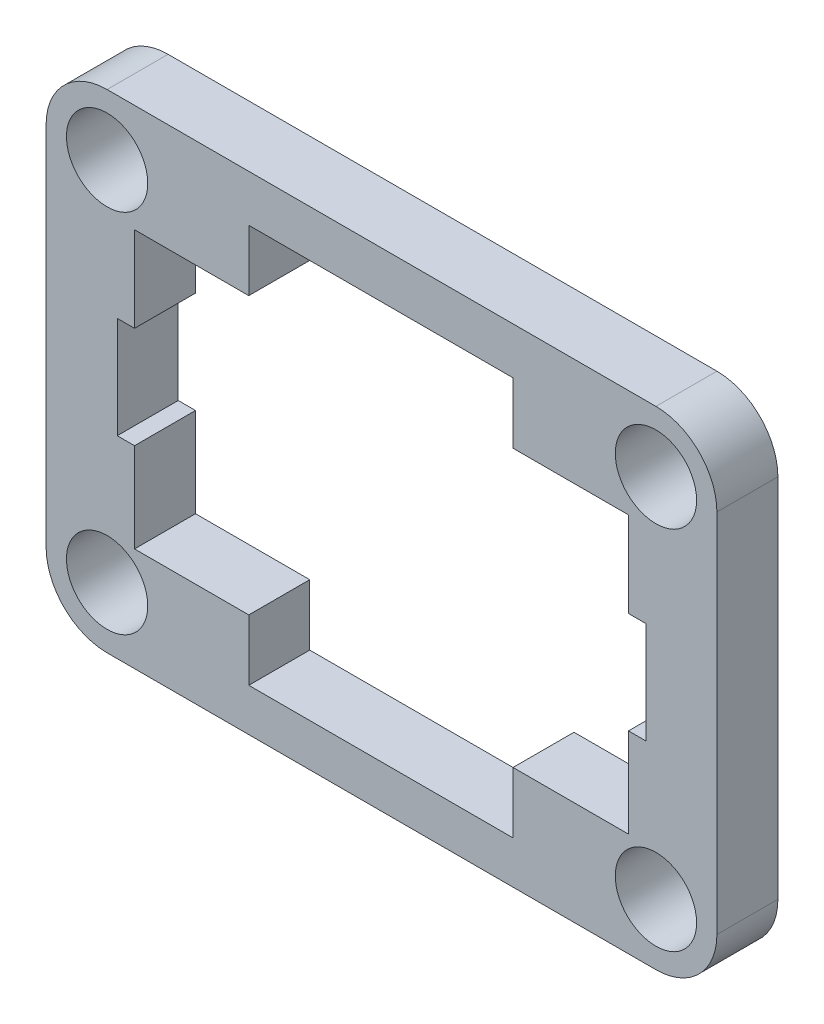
ISO-10303-21;
HEADER;
FILE_DESCRIPTION(('STEP AP214'),'2;1');
FILE_NAME('part.step','',(''),(''),'','','');
FILE_SCHEMA(('AUTOMOTIVE_DESIGN { 1 0 10303 214 1 1 1 1 }'));
ENDSEC;
DATA;
#1=APPLICATION_CONTEXT('core data for automotive mechanical design processes');
#2=APPLICATION_PROTOCOL_DEFINITION('international standard','automotive_design',2000,#1);
#3=PRODUCT_CONTEXT('',#1,'mechanical');
#4=PRODUCT('Part','Part','',(#3));
#5=PRODUCT_RELATED_PRODUCT_CATEGORY('part','',(#4));
#6=PRODUCT_DEFINITION_FORMATION('','',#4);
#7=PRODUCT_DEFINITION_CONTEXT('part definition',#1,'design');
#8=PRODUCT_DEFINITION('design','',#6,#7);
#9=PRODUCT_DEFINITION_SHAPE('','',#8);
#10=(LENGTH_UNIT() NAMED_UNIT(*) SI_UNIT(.MILLI.,.METRE.));
#11=(NAMED_UNIT(*) PLANE_ANGLE_UNIT() SI_UNIT($,.RADIAN.));
#12=(NAMED_UNIT(*) SI_UNIT($,.STERADIAN.) SOLID_ANGLE_UNIT());
#13=UNCERTAINTY_MEASURE_WITH_UNIT(LENGTH_MEASURE(1.E-05),#10,'distance_accuracy_value','');
#14=(GEOMETRIC_REPRESENTATION_CONTEXT(3) GLOBAL_UNCERTAINTY_ASSIGNED_CONTEXT((#13)) GLOBAL_UNIT_ASSIGNED_CONTEXT((#10,
#11,#12)) REPRESENTATION_CONTEXT('',''));
#15=CARTESIAN_POINT('',(0.,0.,0.));
#16=DIRECTION('',(0.,0.,1.));
#17=DIRECTION('',(1.,0.,0.));
#18=AXIS2_PLACEMENT_3D('',#15,#16,#17);
#19=CARTESIAN_POINT('',(27.5302510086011,-20.1514477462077,3.));
#20=DIRECTION('',(0.,-1.,0.));
#21=DIRECTION('',(0.,0.,-1.));
#22=AXIS2_PLACEMENT_3D('',#19,#20,#21);
#23=PLANE('',#22);
#24=DIRECTION('',(1.,0.,0.));
#25=VECTOR('',#24,1.);
#26=CARTESIAN_POINT('',(27.5302510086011,-20.1514477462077,0.));
#27=LINE('',#26,#25);
#28=CARTESIAN_POINT('',(27.5302510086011,-20.1514477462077,0.));
#29=VERTEX_POINT('',#28);
#30=CARTESIAN_POINT('',(28.38,-20.1514477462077,0.));
#31=VERTEX_POINT('',#30);
#32=EDGE_CURVE('E324',#29,#31,#27,.T.);
#33=ORIENTED_EDGE('',*,*,#32,.T.);
#34=DIRECTION('',(0.,0.,1.));
#35=VECTOR('',#34,1.);
#36=CARTESIAN_POINT('',(28.38,-20.1514477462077,3.));
#37=LINE('',#36,#35);
#38=CARTESIAN_POINT('',(28.38,-20.1514477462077,3.));
#39=VERTEX_POINT('',#38);
#40=EDGE_CURVE('E321',#31,#39,#37,.T.);
#41=ORIENTED_EDGE('',*,*,#40,.T.);
#42=DIRECTION('',(1.,0.,0.));
#43=VECTOR('',#42,1.);
#44=CARTESIAN_POINT('',(27.0302510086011,-20.1514477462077,3.));
#45=LINE('',#44,#43);
#46=CARTESIAN_POINT('',(27.5302510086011,-20.1514477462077,3.));
#47=VERTEX_POINT('',#46);
#48=EDGE_CURVE('E396',#47,#39,#45,.T.);
#49=ORIENTED_EDGE('',*,*,#48,.F.);
#50=DIRECTION('',(0.,0.,-1.));
#51=VECTOR('',#50,1.);
#52=CARTESIAN_POINT('',(27.5302510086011,-20.1514477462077,3.));
#53=LINE('',#52,#51);
#54=EDGE_CURVE('E361',#29,#47,#53,.F.);
#55=ORIENTED_EDGE('',*,*,#54,.F.);
#56=EDGE_LOOP('',(#33,#41,#49,#55));
#57=FACE_BOUND('',#56,.T.);
#58=ADVANCED_FACE('F31',(#57),#23,.T.);
#59=CARTESIAN_POINT('',(52.0302510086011,-20.1514477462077,3.));
#60=DIRECTION('',(0.,-1.,0.));
#61=DIRECTION('',(0.,0.,-1.));
#62=AXIS2_PLACEMENT_3D('',#59,#60,#61);
#63=PLANE('',#62);
#64=DIRECTION('',(1.,0.,0.));
#65=VECTOR('',#64,1.);
#66=CARTESIAN_POINT('',(27.0302510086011,-20.1514477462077,3.));
#67=LINE('',#66,#65);
#68=CARTESIAN_POINT('',(52.68,-20.1514477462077,3.));
#69=VERTEX_POINT('',#68);
#70=CARTESIAN_POINT('',(53.5302510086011,-20.1514477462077,3.));
#71=VERTEX_POINT('',#70);
#72=EDGE_CURVE('E394',#69,#71,#67,.T.);
#73=ORIENTED_EDGE('',*,*,#72,.F.);
#74=DIRECTION('',(0.,0.,-1.));
#75=VECTOR('',#74,1.);
#76=CARTESIAN_POINT('',(52.68,-20.1514477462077,3.));
#77=LINE('',#76,#75);
#78=CARTESIAN_POINT('',(52.68,-20.1514477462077,0.));
#79=VERTEX_POINT('',#78);
#80=EDGE_CURVE('E317',#69,#79,#77,.T.);
#81=ORIENTED_EDGE('',*,*,#80,.T.);
#82=DIRECTION('',(1.,0.,0.));
#83=VECTOR('',#82,1.);
#84=CARTESIAN_POINT('',(52.0302510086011,-20.1514477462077,0.));
#85=LINE('',#84,#83);
#86=CARTESIAN_POINT('',(53.5302510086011,-20.1514477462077,0.));
#87=VERTEX_POINT('',#86);
#88=EDGE_CURVE('E406',#79,#87,#85,.T.);
#89=ORIENTED_EDGE('',*,*,#88,.T.);
#90=DIRECTION('',(0.,0.,1.));
#91=VECTOR('',#90,1.);
#92=CARTESIAN_POINT('',(53.5302510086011,-20.1514477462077,3.));
#93=LINE('',#92,#91);
#94=EDGE_CURVE('E347',#71,#87,#93,.F.);
#95=ORIENTED_EDGE('',*,*,#94,.F.);
#96=EDGE_LOOP('',(#73,#81,#89,#95));
#97=FACE_BOUND('',#96,.T.);
#98=ADVANCED_FACE('F439',(#97),#63,.T.);
#99=CARTESIAN_POINT('',(52.0302510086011,-25.1514477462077,3.));
#100=DIRECTION('',(0.,1.,0.));
#101=DIRECTION('',(0.,0.,1.));
#102=AXIS2_PLACEMENT_3D('',#99,#100,#101);
#103=PLANE('',#102);
#104=DIRECTION('',(1.,0.,0.));
#105=VECTOR('',#104,1.);
#106=CARTESIAN_POINT('',(52.0302510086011,-25.1514477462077,0.));
#107=LINE('',#106,#105);
#108=CARTESIAN_POINT('',(53.5302510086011,-25.1514477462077,0.));
#109=VERTEX_POINT('',#108);
#110=CARTESIAN_POINT('',(52.68,-25.1514477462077,0.));
#111=VERTEX_POINT('',#110);
#112=EDGE_CURVE('E403',#109,#111,#107,.F.);
#113=ORIENTED_EDGE('',*,*,#112,.T.);
#114=DIRECTION('',(0.,0.,1.));
#115=VECTOR('',#114,1.);
#116=CARTESIAN_POINT('',(52.68,-25.1514477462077,3.));
#117=LINE('',#116,#115);
#118=CARTESIAN_POINT('',(52.68,-25.1514477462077,3.));
#119=VERTEX_POINT('',#118);
#120=EDGE_CURVE('E53',#111,#119,#117,.T.);
#121=ORIENTED_EDGE('',*,*,#120,.T.);
#122=DIRECTION('',(1.,0.,0.));
#123=VECTOR('',#122,1.);
#124=CARTESIAN_POINT('',(27.0302510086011,-25.1514477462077,3.));
#125=LINE('',#124,#123);
#126=CARTESIAN_POINT('',(53.5302510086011,-25.1514477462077,3.));
#127=VERTEX_POINT('',#126);
#128=EDGE_CURVE('E390',#127,#119,#125,.F.);
#129=ORIENTED_EDGE('',*,*,#128,.F.);
#130=DIRECTION('',(0.,0.,1.));
#131=VECTOR('',#130,1.);
#132=CARTESIAN_POINT('',(53.5302510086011,-25.1514477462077,3.));
#133=LINE('',#132,#131);
#134=EDGE_CURVE('E353',#109,#127,#133,.T.);
#135=ORIENTED_EDGE('',*,*,#134,.F.);
#136=EDGE_LOOP('',(#113,#121,#129,#135));
#137=FACE_BOUND('',#136,.T.);
#138=ADVANCED_FACE('F486',(#137),#103,.T.);
#139=CARTESIAN_POINT('',(27.5302510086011,-25.1514477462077,3.));
#140=DIRECTION('',(0.,1.,0.));
#141=DIRECTION('',(0.,0.,1.));
#142=AXIS2_PLACEMENT_3D('',#139,#140,#141);
#143=PLANE('',#142);
#144=DIRECTION('',(1.,0.,0.));
#145=VECTOR('',#144,1.);
#146=CARTESIAN_POINT('',(27.0302510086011,-25.1514477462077,3.));
#147=LINE('',#146,#145);
#148=CARTESIAN_POINT('',(28.38,-25.1514477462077,3.));
#149=VERTEX_POINT('',#148);
#150=CARTESIAN_POINT('',(27.5302510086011,-25.1514477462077,3.));
#151=VERTEX_POINT('',#150);
#152=EDGE_CURVE('E399',#149,#151,#147,.F.);
#153=ORIENTED_EDGE('',*,*,#152,.F.);
#154=DIRECTION('',(0.,0.,-1.));
#155=VECTOR('',#154,1.);
#156=CARTESIAN_POINT('',(28.38,-25.1514477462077,3.));
#157=LINE('',#156,#155);
#158=CARTESIAN_POINT('',(28.38,-25.1514477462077,0.));
#159=VERTEX_POINT('',#158);
#160=EDGE_CURVE('E222',#149,#159,#157,.T.);
#161=ORIENTED_EDGE('',*,*,#160,.T.);
#162=DIRECTION('',(1.,0.,0.));
#163=VECTOR('',#162,1.);
#164=CARTESIAN_POINT('',(27.5302510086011,-25.1514477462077,0.));
#165=LINE('',#164,#163);
#166=CARTESIAN_POINT('',(27.5302510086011,-25.1514477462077,0.));
#167=VERTEX_POINT('',#166);
#168=EDGE_CURVE('E401',#159,#167,#165,.F.);
#169=ORIENTED_EDGE('',*,*,#168,.T.);
#170=DIRECTION('',(0.,0.,-1.));
#171=VECTOR('',#170,1.);
#172=CARTESIAN_POINT('',(27.5302510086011,-25.1514477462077,3.));
#173=LINE('',#172,#171);
#174=EDGE_CURVE('E355',#151,#167,#173,.T.);
#175=ORIENTED_EDGE('',*,*,#174,.F.);
#176=EDGE_LOOP('',(#153,#161,#169,#175));
#177=FACE_BOUND('',#176,.T.);
#178=ADVANCED_FACE('F484',(#177),#143,.T.);
#179=CARTESIAN_POINT('',(27.0302510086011,-31.6514477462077,3.));
#180=DIRECTION('',(0.,0.,1.));
#181=DIRECTION('',(1.,0.,0.));
#182=AXIS2_PLACEMENT_3D('',#179,#180,#181);
#183=PLANE('',#182);
#184=CARTESIAN_POINT('',(27.0302510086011,-31.6514477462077,3.));
#185=DIRECTION('',(0.,0.,1.));
#186=DIRECTION('',(1.,0.,0.));
#187=AXIS2_PLACEMENT_3D('',#184,#185,#186);
#188=CIRCLE('',#187,2.);
#189=CARTESIAN_POINT('',(29.0302510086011,-31.6514477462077,3.));
#190=VERTEX_POINT('',#189);
#191=EDGE_CURVE('E814',#190,#190,#188,.T.);
#192=ORIENTED_EDGE('',*,*,#191,.F.);
#193=EDGE_LOOP('',(#192));
#194=FACE_BOUND('',#193,.T.);
#195=CARTESIAN_POINT('',(54.0302510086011,-31.6514477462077,3.));
#196=DIRECTION('',(0.,0.,1.));
#197=DIRECTION('',(1.,0.,0.));
#198=AXIS2_PLACEMENT_3D('',#195,#196,#197);
#199=CIRCLE('',#198,2.);
#200=CARTESIAN_POINT('',(56.0302510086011,-31.6514477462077,3.));
#201=VERTEX_POINT('',#200);
#202=EDGE_CURVE('E816',#201,#201,#199,.T.);
#203=ORIENTED_EDGE('',*,*,#202,.F.);
#204=EDGE_LOOP('',(#203));
#205=FACE_BOUND('',#204,.T.);
#206=CARTESIAN_POINT('',(54.0302510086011,-13.6514477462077,3.));
#207=DIRECTION('',(0.,0.,1.));
#208=DIRECTION('',(1.,0.,0.));
#209=AXIS2_PLACEMENT_3D('',#206,#207,#208);
#210=CIRCLE('',#209,2.);
#211=CARTESIAN_POINT('',(56.0302510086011,-13.6514477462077,3.));
#212=VERTEX_POINT('',#211);
#213=EDGE_CURVE('E822',#212,#212,#210,.T.);
#214=ORIENTED_EDGE('',*,*,#213,.F.);
#215=EDGE_LOOP('',(#214));
#216=FACE_BOUND('',#215,.T.);
#217=CARTESIAN_POINT('',(27.0302510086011,-13.6514477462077,3.));
#218=DIRECTION('',(0.,0.,1.));
#219=DIRECTION('',(1.,0.,0.));
#220=AXIS2_PLACEMENT_3D('',#217,#218,#219);
#221=CIRCLE('',#220,2.);
#222=CARTESIAN_POINT('',(29.0302510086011,-13.6514477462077,3.));
#223=VERTEX_POINT('',#222);
#224=EDGE_CURVE('E828',#223,#223,#221,.T.);
#225=ORIENTED_EDGE('',*,*,#224,.F.);
#226=EDGE_LOOP('',(#225));
#227=FACE_BOUND('',#226,.T.);
#228=CARTESIAN_POINT('',(27.0302510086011,-13.6514477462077,3.));
#229=DIRECTION('',(0.,0.,-1.));
#230=DIRECTION('',(-1.,0.,0.));
#231=AXIS2_PLACEMENT_3D('',#228,#229,#230);
#232=CIRCLE('',#231,3.);
#233=CARTESIAN_POINT('',(24.0302510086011,-13.6514477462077,3.));
#234=VERTEX_POINT('',#233);
#235=CARTESIAN_POINT('',(27.0302510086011,-10.6514477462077,3.));
#236=VERTEX_POINT('',#235);
#237=EDGE_CURVE('E375',#234,#236,#232,.T.);
#238=ORIENTED_EDGE('',*,*,#237,.F.);
#239=DIRECTION('',(0.,1.,0.));
#240=VECTOR('',#239,1.);
#241=CARTESIAN_POINT('',(24.0302510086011,-13.6514477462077,3.));
#242=LINE('',#241,#240);
#243=CARTESIAN_POINT('',(24.0302510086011,-31.6514477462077,3.));
#244=VERTEX_POINT('',#243);
#245=EDGE_CURVE('E369',#234,#244,#242,.F.);
#246=ORIENTED_EDGE('',*,*,#245,.T.);
#247=CARTESIAN_POINT('',(27.0302510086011,-31.6514477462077,3.));
#248=DIRECTION('',(0.,0.,-1.));
#249=DIRECTION('',(-1.,0.,0.));
#250=AXIS2_PLACEMENT_3D('',#247,#248,#249);
#251=CIRCLE('',#250,3.);
#252=CARTESIAN_POINT('',(27.0302510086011,-34.6514477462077,3.));
#253=VERTEX_POINT('',#252);
#254=EDGE_CURVE('E365',#253,#244,#251,.T.);
#255=ORIENTED_EDGE('',*,*,#254,.F.);
#256=DIRECTION('',(1.,0.,0.));
#257=VECTOR('',#256,1.);
#258=CARTESIAN_POINT('',(27.0302510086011,-34.6514477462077,3.));
#259=LINE('',#258,#257);
#260=CARTESIAN_POINT('',(54.0302510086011,-34.6514477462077,3.));
#261=VERTEX_POINT('',#260);
#262=EDGE_CURVE('E393',#253,#261,#259,.T.);
#263=ORIENTED_EDGE('',*,*,#262,.T.);
#264=CARTESIAN_POINT('',(54.0302510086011,-31.6514477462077,3.));
#265=DIRECTION('',(0.,0.,-1.));
#266=DIRECTION('',(-1.,0.,0.));
#267=AXIS2_PLACEMENT_3D('',#264,#265,#266);
#268=CIRCLE('',#267,3.);
#269=CARTESIAN_POINT('',(57.0302510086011,-31.6514477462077,3.));
#270=VERTEX_POINT('',#269);
#271=EDGE_CURVE('E389',#270,#261,#268,.T.);
#272=ORIENTED_EDGE('',*,*,#271,.F.);
#273=DIRECTION('',(0.,-1.,0.));
#274=VECTOR('',#273,1.);
#275=CARTESIAN_POINT('',(57.0302510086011,-13.6514477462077,3.));
#276=LINE('',#275,#274);
#277=CARTESIAN_POINT('',(57.0302510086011,-13.6514477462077,3.));
#278=VERTEX_POINT('',#277);
#279=EDGE_CURVE('E386',#270,#278,#276,.F.);
#280=ORIENTED_EDGE('',*,*,#279,.T.);
#281=CARTESIAN_POINT('',(54.0302510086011,-13.6514477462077,3.));
#282=DIRECTION('',(0.,0.,-1.));
#283=DIRECTION('',(-1.,0.,0.));
#284=AXIS2_PLACEMENT_3D('',#281,#282,#283);
#285=CIRCLE('',#284,3.);
#286=CARTESIAN_POINT('',(54.0302510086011,-10.6514477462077,3.));
#287=VERTEX_POINT('',#286);
#288=EDGE_CURVE('E382',#287,#278,#285,.T.);
#289=ORIENTED_EDGE('',*,*,#288,.F.);
#290=DIRECTION('',(1.,0.,0.));
#291=VECTOR('',#290,1.);
#292=CARTESIAN_POINT('',(27.0302510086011,-10.6514477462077,3.));
#293=LINE('',#292,#291);
#294=EDGE_CURVE('E379',#287,#236,#293,.F.);
#295=ORIENTED_EDGE('',*,*,#294,.T.);
#296=EDGE_LOOP('',(#238,#246,#255,#263,#272,#280,#289,#295));
#297=FACE_BOUND('',#296,.T.);
#298=DIRECTION('',(1.,0.,0.));
#299=VECTOR('',#298,1.);
#300=CARTESIAN_POINT('',(34.,-29.55,3.));
#301=LINE('',#300,#299);
#302=CARTESIAN_POINT('',(28.38,-29.55,3.));
#303=VERTEX_POINT('',#302);
#304=CARTESIAN_POINT('',(34.,-29.55,3.));
#305=VERTEX_POINT('',#304);
#306=EDGE_CURVE('E231',#303,#305,#301,.T.);
#307=ORIENTED_EDGE('',*,*,#306,.F.);
#308=DIRECTION('',(0.,-1.,0.));
#309=VECTOR('',#308,1.);
#310=CARTESIAN_POINT('',(28.38,-15.95,3.));
#311=LINE('',#310,#309);
#312=EDGE_CURVE('E216',#149,#303,#311,.T.);
#313=ORIENTED_EDGE('',*,*,#312,.F.);
#314=ORIENTED_EDGE('',*,*,#152,.T.);
#315=DIRECTION('',(0.,1.,0.));
#316=VECTOR('',#315,1.);
#317=CARTESIAN_POINT('',(27.5302510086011,-20.1514477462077,3.));
#318=LINE('',#317,#316);
#319=EDGE_CURVE('E358',#47,#151,#318,.F.);
#320=ORIENTED_EDGE('',*,*,#319,.F.);
#321=ORIENTED_EDGE('',*,*,#48,.T.);
#322=CARTESIAN_POINT('',(28.38,-15.95,3.));
#323=VERTEX_POINT('',#322);
#324=EDGE_CURVE('E226',#323,#39,#311,.T.);
#325=ORIENTED_EDGE('',*,*,#324,.F.);
#326=DIRECTION('',(-1.,0.,0.));
#327=VECTOR('',#326,1.);
#328=CARTESIAN_POINT('',(28.38,-15.95,3.));
#329=LINE('',#328,#327);
#330=CARTESIAN_POINT('',(34.,-15.95,3.));
#331=VERTEX_POINT('',#330);
#332=EDGE_CURVE('E262',#331,#323,#329,.T.);
#333=ORIENTED_EDGE('',*,*,#332,.F.);
#334=DIRECTION('',(0.,-1.,0.));
#335=VECTOR('',#334,1.);
#336=CARTESIAN_POINT('',(34.,-15.95,3.));
#337=LINE('',#336,#335);
#338=CARTESIAN_POINT('',(34.,-12.95,3.));
#339=VERTEX_POINT('',#338);
#340=EDGE_CURVE('E260',#339,#331,#337,.T.);
#341=ORIENTED_EDGE('',*,*,#340,.F.);
#342=DIRECTION('',(-1.,0.,0.));
#343=VECTOR('',#342,1.);
#344=CARTESIAN_POINT('',(34.,-12.95,3.));
#345=LINE('',#344,#343);
#346=CARTESIAN_POINT('',(47.,-12.95,3.));
#347=VERTEX_POINT('',#346);
#348=EDGE_CURVE('E258',#347,#339,#345,.T.);
#349=ORIENTED_EDGE('',*,*,#348,.F.);
#350=DIRECTION('',(0.,1.,0.));
#351=VECTOR('',#350,1.);
#352=CARTESIAN_POINT('',(47.,-15.95,3.));
#353=LINE('',#352,#351);
#354=CARTESIAN_POINT('',(47.,-15.95,3.));
#355=VERTEX_POINT('',#354);
#356=EDGE_CURVE('E256',#355,#347,#353,.T.);
#357=ORIENTED_EDGE('',*,*,#356,.F.);
#358=DIRECTION('',(-1.,0.,0.));
#359=VECTOR('',#358,1.);
#360=CARTESIAN_POINT('',(47.,-15.95,3.));
#361=LINE('',#360,#359);
#362=CARTESIAN_POINT('',(52.68,-15.95,3.));
#363=VERTEX_POINT('',#362);
#364=EDGE_CURVE('E254',#363,#355,#361,.T.);
#365=ORIENTED_EDGE('',*,*,#364,.F.);
#366=DIRECTION('',(0.,1.,0.));
#367=VECTOR('',#366,1.);
#368=CARTESIAN_POINT('',(52.68,-15.95,3.));
#369=LINE('',#368,#367);
#370=EDGE_CURVE('E251',#69,#363,#369,.T.);
#371=ORIENTED_EDGE('',*,*,#370,.F.);
#372=ORIENTED_EDGE('',*,*,#72,.T.);
#373=DIRECTION('',(0.,1.,0.));
#374=VECTOR('',#373,1.);
#375=CARTESIAN_POINT('',(53.5302510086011,-20.1514477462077,3.));
#376=LINE('',#375,#374);
#377=EDGE_CURVE('E350',#127,#71,#376,.T.);
#378=ORIENTED_EDGE('',*,*,#377,.F.);
#379=ORIENTED_EDGE('',*,*,#128,.T.);
#380=CARTESIAN_POINT('',(52.68,-29.55,3.));
#381=VERTEX_POINT('',#380);
#382=EDGE_CURVE('E252',#381,#119,#369,.T.);
#383=ORIENTED_EDGE('',*,*,#382,.F.);
#384=DIRECTION('',(1.,0.,0.));
#385=VECTOR('',#384,1.);
#386=CARTESIAN_POINT('',(52.68,-29.55,3.));
#387=LINE('',#386,#385);
#388=CARTESIAN_POINT('',(47.,-29.55,3.));
#389=VERTEX_POINT('',#388);
#390=EDGE_CURVE('E249',#389,#381,#387,.T.);
#391=ORIENTED_EDGE('',*,*,#390,.F.);
#392=DIRECTION('',(0.,1.,0.));
#393=VECTOR('',#392,1.);
#394=CARTESIAN_POINT('',(47.,-29.55,3.));
#395=LINE('',#394,#393);
#396=CARTESIAN_POINT('',(47.,-32.55,3.));
#397=VERTEX_POINT('',#396);
#398=EDGE_CURVE('E247',#397,#389,#395,.T.);
#399=ORIENTED_EDGE('',*,*,#398,.F.);
#400=DIRECTION('',(1.,0.,0.));
#401=VECTOR('',#400,1.);
#402=CARTESIAN_POINT('',(47.,-32.55,3.));
#403=LINE('',#402,#401);
#404=CARTESIAN_POINT('',(34.,-32.55,3.));
#405=VERTEX_POINT('',#404);
#406=EDGE_CURVE('E242',#405,#397,#403,.T.);
#407=ORIENTED_EDGE('',*,*,#406,.F.);
#408=DIRECTION('',(0.,-1.,0.));
#409=VECTOR('',#408,1.);
#410=CARTESIAN_POINT('',(34.,-29.55,3.));
#411=LINE('',#410,#409);
#412=EDGE_CURVE('E240',#305,#405,#411,.T.);
#413=ORIENTED_EDGE('',*,*,#412,.F.);
#414=EDGE_LOOP('',(#307,#313,#314,#320,#321,#325,#333,#341,#349,#357,#365,#371,#372,#378,#379,
#383,#391,#399,#407,#413));
#415=FACE_BOUND('',#414,.T.);
#416=ADVANCED_FACE('F238',(#194,#205,#216,#227,#297,#415),#183,.T.);
#417=CARTESIAN_POINT('',(27.0302510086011,-31.6514477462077,0.));
#418=DIRECTION('',(0.,0.,1.));
#419=DIRECTION('',(1.,0.,0.));
#420=AXIS2_PLACEMENT_3D('',#417,#418,#419);
#421=PLANE('',#420);
#422=CARTESIAN_POINT('',(27.0302510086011,-31.6514477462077,0.));
#423=DIRECTION('',(0.,0.,1.));
#424=DIRECTION('',(1.,0.,0.));
#425=AXIS2_PLACEMENT_3D('',#422,#423,#424);
#426=CIRCLE('',#425,2.);
#427=CARTESIAN_POINT('',(29.0302510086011,-31.6514477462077,0.));
#428=VERTEX_POINT('',#427);
#429=EDGE_CURVE('E811',#428,#428,#426,.T.);
#430=ORIENTED_EDGE('',*,*,#429,.T.);
#431=EDGE_LOOP('',(#430));
#432=FACE_BOUND('',#431,.T.);
#433=CARTESIAN_POINT('',(54.0302510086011,-31.6514477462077,0.));
#434=DIRECTION('',(0.,0.,1.));
#435=DIRECTION('',(1.,0.,0.));
#436=AXIS2_PLACEMENT_3D('',#433,#434,#435);
#437=CIRCLE('',#436,2.);
#438=CARTESIAN_POINT('',(56.0302510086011,-31.6514477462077,0.));
#439=VERTEX_POINT('',#438);
#440=EDGE_CURVE('E819',#439,#439,#437,.T.);
#441=ORIENTED_EDGE('',*,*,#440,.T.);
#442=EDGE_LOOP('',(#441));
#443=FACE_BOUND('',#442,.T.);
#444=CARTESIAN_POINT('',(54.0302510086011,-13.6514477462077,0.));
#445=DIRECTION('',(0.,0.,1.));
#446=DIRECTION('',(1.,0.,0.));
#447=AXIS2_PLACEMENT_3D('',#444,#445,#446);
#448=CIRCLE('',#447,2.);
#449=CARTESIAN_POINT('',(56.0302510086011,-13.6514477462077,0.));
#450=VERTEX_POINT('',#449);
#451=EDGE_CURVE('E825',#450,#450,#448,.T.);
#452=ORIENTED_EDGE('',*,*,#451,.T.);
#453=EDGE_LOOP('',(#452));
#454=FACE_BOUND('',#453,.T.);
#455=CARTESIAN_POINT('',(27.0302510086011,-13.6514477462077,0.));
#456=DIRECTION('',(0.,0.,1.));
#457=DIRECTION('',(1.,0.,0.));
#458=AXIS2_PLACEMENT_3D('',#455,#456,#457);
#459=CIRCLE('',#458,2.);
#460=CARTESIAN_POINT('',(29.0302510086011,-13.6514477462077,0.));
#461=VERTEX_POINT('',#460);
#462=EDGE_CURVE('E266',#461,#461,#459,.T.);
#463=ORIENTED_EDGE('',*,*,#462,.T.);
#464=EDGE_LOOP('',(#463));
#465=FACE_BOUND('',#464,.T.);
#466=DIRECTION('',(0.,1.,0.));
#467=VECTOR('',#466,1.);
#468=CARTESIAN_POINT('',(24.0302510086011,-31.6514477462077,0.));
#469=LINE('',#468,#467);
#470=CARTESIAN_POINT('',(24.0302510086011,-13.6514477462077,0.));
#471=VERTEX_POINT('',#470);
#472=CARTESIAN_POINT('',(24.0302510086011,-31.6514477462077,0.));
#473=VERTEX_POINT('',#472);
#474=EDGE_CURVE('E332',#471,#473,#469,.F.);
#475=ORIENTED_EDGE('',*,*,#474,.F.);
#476=CARTESIAN_POINT('',(27.0302510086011,-13.6514477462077,0.));
#477=DIRECTION('',(0.,0.,-1.));
#478=DIRECTION('',(-1.,0.,0.));
#479=AXIS2_PLACEMENT_3D('',#476,#477,#478);
#480=CIRCLE('',#479,3.);
#481=CARTESIAN_POINT('',(27.0302510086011,-10.6514477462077,0.));
#482=VERTEX_POINT('',#481);
#483=EDGE_CURVE('E335',#482,#471,#480,.F.);
#484=ORIENTED_EDGE('',*,*,#483,.F.);
#485=DIRECTION('',(1.,0.,0.));
#486=VECTOR('',#485,1.);
#487=CARTESIAN_POINT('',(27.0302510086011,-10.6514477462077,0.));
#488=LINE('',#487,#486);
#489=CARTESIAN_POINT('',(54.0302510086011,-10.6514477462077,0.));
#490=VERTEX_POINT('',#489);
#491=EDGE_CURVE('E336',#490,#482,#488,.F.);
#492=ORIENTED_EDGE('',*,*,#491,.F.);
#493=CARTESIAN_POINT('',(54.0302510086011,-13.6514477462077,0.));
#494=DIRECTION('',(0.,0.,-1.));
#495=DIRECTION('',(-1.,0.,0.));
#496=AXIS2_PLACEMENT_3D('',#493,#494,#495);
#497=CIRCLE('',#496,3.);
#498=CARTESIAN_POINT('',(57.0302510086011,-13.6514477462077,0.));
#499=VERTEX_POINT('',#498);
#500=EDGE_CURVE('E339',#499,#490,#497,.F.);
#501=ORIENTED_EDGE('',*,*,#500,.F.);
#502=DIRECTION('',(0.,1.,0.));
#503=VECTOR('',#502,1.);
#504=CARTESIAN_POINT('',(57.0302510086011,-31.6514477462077,0.));
#505=LINE('',#504,#503);
#506=CARTESIAN_POINT('',(57.0302510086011,-31.6514477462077,0.));
#507=VERTEX_POINT('',#506);
#508=EDGE_CURVE('E340',#507,#499,#505,.T.);
#509=ORIENTED_EDGE('',*,*,#508,.F.);
#510=CARTESIAN_POINT('',(54.0302510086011,-31.6514477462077,0.));
#511=DIRECTION('',(0.,0.,-1.));
#512=DIRECTION('',(-1.,0.,0.));
#513=AXIS2_PLACEMENT_3D('',#510,#511,#512);
#514=CIRCLE('',#513,3.);
#515=CARTESIAN_POINT('',(54.0302510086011,-34.6514477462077,0.));
#516=VERTEX_POINT('',#515);
#517=EDGE_CURVE('E343',#516,#507,#514,.F.);
#518=ORIENTED_EDGE('',*,*,#517,.F.);
#519=DIRECTION('',(1.,0.,0.));
#520=VECTOR('',#519,1.);
#521=CARTESIAN_POINT('',(27.0302510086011,-34.6514477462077,0.));
#522=LINE('',#521,#520);
#523=CARTESIAN_POINT('',(27.0302510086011,-34.6514477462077,0.));
#524=VERTEX_POINT('',#523);
#525=EDGE_CURVE('E344',#524,#516,#522,.T.);
#526=ORIENTED_EDGE('',*,*,#525,.F.);
#527=CARTESIAN_POINT('',(27.0302510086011,-31.6514477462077,0.));
#528=DIRECTION('',(0.,0.,-1.));
#529=DIRECTION('',(-1.,0.,0.));
#530=AXIS2_PLACEMENT_3D('',#527,#528,#529);
#531=CIRCLE('',#530,3.);
#532=EDGE_CURVE('E331',#473,#524,#531,.F.);
#533=ORIENTED_EDGE('',*,*,#532,.F.);
#534=EDGE_LOOP('',(#475,#484,#492,#501,#509,#518,#526,#533));
#535=FACE_BOUND('',#534,.T.);
#536=DIRECTION('',(0.,1.,0.));
#537=VECTOR('',#536,1.);
#538=CARTESIAN_POINT('',(28.38,-31.6514477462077,0.));
#539=LINE('',#538,#537);
#540=CARTESIAN_POINT('',(28.38,-29.55,0.));
#541=VERTEX_POINT('',#540);
#542=EDGE_CURVE('E11',#541,#159,#539,.T.);
#543=ORIENTED_EDGE('',*,*,#542,.F.);
#544=DIRECTION('',(1.,0.,0.));
#545=VECTOR('',#544,1.);
#546=CARTESIAN_POINT('',(34.,-29.55,0.));
#547=LINE('',#546,#545);
#548=CARTESIAN_POINT('',(34.,-29.55,0.));
#549=VERTEX_POINT('',#548);
#550=EDGE_CURVE('E234',#541,#549,#547,.T.);
#551=ORIENTED_EDGE('',*,*,#550,.T.);
#552=DIRECTION('',(0.,-1.,0.));
#553=VECTOR('',#552,1.);
#554=CARTESIAN_POINT('',(34.,-29.55,0.));
#555=LINE('',#554,#553);
#556=CARTESIAN_POINT('',(34.,-32.55,0.));
#557=VERTEX_POINT('',#556);
#558=EDGE_CURVE('E268',#549,#557,#555,.T.);
#559=ORIENTED_EDGE('',*,*,#558,.T.);
#560=DIRECTION('',(1.,0.,0.));
#561=VECTOR('',#560,1.);
#562=CARTESIAN_POINT('',(47.,-32.55,0.));
#563=LINE('',#562,#561);
#564=CARTESIAN_POINT('',(47.,-32.55,0.));
#565=VERTEX_POINT('',#564);
#566=EDGE_CURVE('E271',#557,#565,#563,.T.);
#567=ORIENTED_EDGE('',*,*,#566,.T.);
#568=DIRECTION('',(0.,1.,0.));
#569=VECTOR('',#568,1.);
#570=CARTESIAN_POINT('',(47.,-29.55,0.));
#571=LINE('',#570,#569);
#572=CARTESIAN_POINT('',(47.,-29.55,0.));
#573=VERTEX_POINT('',#572);
#574=EDGE_CURVE('E274',#565,#573,#571,.T.);
#575=ORIENTED_EDGE('',*,*,#574,.T.);
#576=DIRECTION('',(1.,0.,0.));
#577=VECTOR('',#576,1.);
#578=CARTESIAN_POINT('',(52.68,-29.55,0.));
#579=LINE('',#578,#577);
#580=CARTESIAN_POINT('',(52.68,-29.55,0.));
#581=VERTEX_POINT('',#580);
#582=EDGE_CURVE('E277',#573,#581,#579,.T.);
#583=ORIENTED_EDGE('',*,*,#582,.T.);
#584=DIRECTION('',(0.,1.,0.));
#585=VECTOR('',#584,1.);
#586=CARTESIAN_POINT('',(52.68,-15.95,0.));
#587=LINE('',#586,#585);
#588=EDGE_CURVE('E280',#581,#111,#587,.T.);
#589=ORIENTED_EDGE('',*,*,#588,.T.);
#590=ORIENTED_EDGE('',*,*,#112,.F.);
#591=DIRECTION('',(0.,1.,0.));
#592=VECTOR('',#591,1.);
#593=CARTESIAN_POINT('',(53.5302510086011,-31.6514477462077,0.));
#594=LINE('',#593,#592);
#595=EDGE_CURVE('E325',#87,#109,#594,.F.);
#596=ORIENTED_EDGE('',*,*,#595,.F.);
#597=ORIENTED_EDGE('',*,*,#88,.F.);
#598=DIRECTION('',(0.,-1.,0.));
#599=VECTOR('',#598,1.);
#600=CARTESIAN_POINT('',(52.68,-31.6514477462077,0.));
#601=LINE('',#600,#599);
#602=CARTESIAN_POINT('',(52.68,-15.95,0.));
#603=VERTEX_POINT('',#602);
#604=EDGE_CURVE('E38',#603,#79,#601,.T.);
#605=ORIENTED_EDGE('',*,*,#604,.F.);
#606=DIRECTION('',(-1.,0.,0.));
#607=VECTOR('',#606,1.);
#608=CARTESIAN_POINT('',(47.,-15.95,0.));
#609=LINE('',#608,#607);
#610=CARTESIAN_POINT('',(47.,-15.95,0.));
#611=VERTEX_POINT('',#610);
#612=EDGE_CURVE('E282',#603,#611,#609,.T.);
#613=ORIENTED_EDGE('',*,*,#612,.T.);
#614=DIRECTION('',(0.,1.,0.));
#615=VECTOR('',#614,1.);
#616=CARTESIAN_POINT('',(47.,-15.95,0.));
#617=LINE('',#616,#615);
#618=CARTESIAN_POINT('',(47.,-12.95,0.));
#619=VERTEX_POINT('',#618);
#620=EDGE_CURVE('E285',#611,#619,#617,.T.);
#621=ORIENTED_EDGE('',*,*,#620,.T.);
#622=DIRECTION('',(-1.,0.,0.));
#623=VECTOR('',#622,1.);
#624=CARTESIAN_POINT('',(34.,-12.95,0.));
#625=LINE('',#624,#623);
#626=CARTESIAN_POINT('',(34.,-12.95,0.));
#627=VERTEX_POINT('',#626);
#628=EDGE_CURVE('E288',#619,#627,#625,.T.);
#629=ORIENTED_EDGE('',*,*,#628,.T.);
#630=DIRECTION('',(0.,-1.,0.));
#631=VECTOR('',#630,1.);
#632=CARTESIAN_POINT('',(34.,-15.95,0.));
#633=LINE('',#632,#631);
#634=CARTESIAN_POINT('',(34.,-15.95,0.));
#635=VERTEX_POINT('',#634);
#636=EDGE_CURVE('E291',#627,#635,#633,.T.);
#637=ORIENTED_EDGE('',*,*,#636,.T.);
#638=DIRECTION('',(-1.,0.,0.));
#639=VECTOR('',#638,1.);
#640=CARTESIAN_POINT('',(28.38,-15.95,0.));
#641=LINE('',#640,#639);
#642=CARTESIAN_POINT('',(28.38,-15.95,0.));
#643=VERTEX_POINT('',#642);
#644=EDGE_CURVE('E227',#635,#643,#641,.T.);
#645=ORIENTED_EDGE('',*,*,#644,.T.);
#646=DIRECTION('',(0.,-1.,0.));
#647=VECTOR('',#646,1.);
#648=CARTESIAN_POINT('',(28.38,-15.95,0.));
#649=LINE('',#648,#647);
#650=EDGE_CURVE('E45',#643,#31,#649,.T.);
#651=ORIENTED_EDGE('',*,*,#650,.T.);
#652=ORIENTED_EDGE('',*,*,#32,.F.);
#653=DIRECTION('',(0.,1.,0.));
#654=VECTOR('',#653,1.);
#655=CARTESIAN_POINT('',(27.5302510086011,-31.6514477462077,0.));
#656=LINE('',#655,#654);
#657=EDGE_CURVE('E328',#167,#29,#656,.T.);
#658=ORIENTED_EDGE('',*,*,#657,.F.);
#659=ORIENTED_EDGE('',*,*,#168,.F.);
#660=EDGE_LOOP('',(#543,#551,#559,#567,#575,#583,#589,#590,#596,#597,#605,#613,#621,#629,#637,
#645,#651,#652,#658,#659));
#661=FACE_BOUND('',#660,.T.);
#662=ADVANCED_FACE('F442',(#432,#443,#454,#465,#535,#661),#421,.F.);
#663=CARTESIAN_POINT('',(27.0302510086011,-34.6514477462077,3.));
#664=DIRECTION('',(0.,1.,0.));
#665=DIRECTION('',(0.,0.,1.));
#666=AXIS2_PLACEMENT_3D('',#663,#664,#665);
#667=PLANE('',#666);
#668=DIRECTION('',(0.,0.,-1.));
#669=VECTOR('',#668,1.);
#670=CARTESIAN_POINT('',(54.0302510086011,-34.6514477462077,3.));
#671=LINE('',#670,#669);
#672=EDGE_CURVE('E387',#261,#516,#671,.T.);
#673=ORIENTED_EDGE('',*,*,#672,.F.);
#674=ORIENTED_EDGE('',*,*,#262,.F.);
#675=DIRECTION('',(0.,0.,-1.));
#676=VECTOR('',#675,1.);
#677=CARTESIAN_POINT('',(27.0302510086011,-34.6514477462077,3.));
#678=LINE('',#677,#676);
#679=EDGE_CURVE('E366',#524,#253,#678,.F.);
#680=ORIENTED_EDGE('',*,*,#679,.F.);
#681=ORIENTED_EDGE('',*,*,#525,.T.);
#682=EDGE_LOOP('',(#673,#674,#680,#681));
#683=FACE_BOUND('',#682,.T.);
#684=ADVANCED_FACE('F521',(#683),#667,.F.);
#685=CARTESIAN_POINT('',(54.0302510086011,-31.6514477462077,3.));
#686=DIRECTION('',(0.,0.,-1.));
#687=DIRECTION('',(-1.,0.,0.));
#688=AXIS2_PLACEMENT_3D('',#685,#686,#687);
#689=CYLINDRICAL_SURFACE('',#688,3.);
#690=ORIENTED_EDGE('',*,*,#271,.T.);
#691=ORIENTED_EDGE('',*,*,#672,.T.);
#692=ORIENTED_EDGE('',*,*,#517,.T.);
#693=DIRECTION('',(0.,0.,1.));
#694=VECTOR('',#693,1.);
#695=CARTESIAN_POINT('',(57.0302510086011,-31.6514477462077,3.));
#696=LINE('',#695,#694);
#697=EDGE_CURVE('E383',#507,#270,#696,.T.);
#698=ORIENTED_EDGE('',*,*,#697,.T.);
#699=EDGE_LOOP('',(#690,#691,#692,#698));
#700=FACE_BOUND('',#699,.T.);
#701=ADVANCED_FACE('F722',(#700),#689,.T.);
#702=CARTESIAN_POINT('',(57.0302510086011,-13.6514477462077,3.));
#703=DIRECTION('',(-1.,0.,0.));
#704=DIRECTION('',(0.,-1.,0.));
#705=AXIS2_PLACEMENT_3D('',#702,#703,#704);
#706=PLANE('',#705);
#707=DIRECTION('',(0.,0.,-1.));
#708=VECTOR('',#707,1.);
#709=CARTESIAN_POINT('',(57.0302510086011,-13.6514477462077,3.));
#710=LINE('',#709,#708);
#711=EDGE_CURVE('E380',#278,#499,#710,.T.);
#712=ORIENTED_EDGE('',*,*,#711,.F.);
#713=ORIENTED_EDGE('',*,*,#279,.F.);
#714=ORIENTED_EDGE('',*,*,#697,.F.);
#715=ORIENTED_EDGE('',*,*,#508,.T.);
#716=EDGE_LOOP('',(#712,#713,#714,#715));
#717=FACE_BOUND('',#716,.T.);
#718=ADVANCED_FACE('F718',(#717),#706,.F.);
#719=CARTESIAN_POINT('',(54.0302510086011,-13.6514477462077,3.));
#720=DIRECTION('',(0.,0.,-1.));
#721=DIRECTION('',(-1.,0.,0.));
#722=AXIS2_PLACEMENT_3D('',#719,#720,#721);
#723=CYLINDRICAL_SURFACE('',#722,3.);
#724=ORIENTED_EDGE('',*,*,#288,.T.);
#725=ORIENTED_EDGE('',*,*,#711,.T.);
#726=ORIENTED_EDGE('',*,*,#500,.T.);
#727=DIRECTION('',(0.,0.,-1.));
#728=VECTOR('',#727,1.);
#729=CARTESIAN_POINT('',(54.0302510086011,-10.6514477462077,3.));
#730=LINE('',#729,#728);
#731=EDGE_CURVE('E376',#490,#287,#730,.F.);
#732=ORIENTED_EDGE('',*,*,#731,.T.);
#733=EDGE_LOOP('',(#724,#725,#726,#732));
#734=FACE_BOUND('',#733,.T.);
#735=ADVANCED_FACE('F714',(#734),#723,.T.);
#736=CARTESIAN_POINT('',(27.0302510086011,-10.6514477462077,3.));
#737=DIRECTION('',(0.,-1.,0.));
#738=DIRECTION('',(0.,0.,-1.));
#739=AXIS2_PLACEMENT_3D('',#736,#737,#738);
#740=PLANE('',#739);
#741=DIRECTION('',(0.,0.,-1.));
#742=VECTOR('',#741,1.);
#743=CARTESIAN_POINT('',(27.0302510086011,-10.6514477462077,3.));
#744=LINE('',#743,#742);
#745=EDGE_CURVE('E373',#236,#482,#744,.T.);
#746=ORIENTED_EDGE('',*,*,#745,.F.);
#747=ORIENTED_EDGE('',*,*,#294,.F.);
#748=ORIENTED_EDGE('',*,*,#731,.F.);
#749=ORIENTED_EDGE('',*,*,#491,.T.);
#750=EDGE_LOOP('',(#746,#747,#748,#749));
#751=FACE_BOUND('',#750,.T.);
#752=ADVANCED_FACE('F710',(#751),#740,.F.);
#753=CARTESIAN_POINT('',(27.0302510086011,-13.6514477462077,3.));
#754=DIRECTION('',(0.,0.,-1.));
#755=DIRECTION('',(-1.,0.,0.));
#756=AXIS2_PLACEMENT_3D('',#753,#754,#755);
#757=CYLINDRICAL_SURFACE('',#756,3.);
#758=ORIENTED_EDGE('',*,*,#237,.T.);
#759=ORIENTED_EDGE('',*,*,#745,.T.);
#760=ORIENTED_EDGE('',*,*,#483,.T.);
#761=DIRECTION('',(0.,0.,1.));
#762=VECTOR('',#761,1.);
#763=CARTESIAN_POINT('',(24.0302510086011,-13.6514477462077,3.));
#764=LINE('',#763,#762);
#765=EDGE_CURVE('E370',#471,#234,#764,.T.);
#766=ORIENTED_EDGE('',*,*,#765,.T.);
#767=EDGE_LOOP('',(#758,#759,#760,#766));
#768=FACE_BOUND('',#767,.T.);
#769=ADVANCED_FACE('F706',(#768),#757,.T.);
#770=CARTESIAN_POINT('',(24.0302510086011,-13.6514477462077,3.));
#771=DIRECTION('',(1.,0.,0.));
#772=DIRECTION('',(0.,1.,0.));
#773=AXIS2_PLACEMENT_3D('',#770,#771,#772);
#774=PLANE('',#773);
#775=DIRECTION('',(0.,0.,-1.));
#776=VECTOR('',#775,1.);
#777=CARTESIAN_POINT('',(24.0302510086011,-31.6514477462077,3.));
#778=LINE('',#777,#776);
#779=EDGE_CURVE('E363',#244,#473,#778,.T.);
#780=ORIENTED_EDGE('',*,*,#779,.F.);
#781=ORIENTED_EDGE('',*,*,#245,.F.);
#782=ORIENTED_EDGE('',*,*,#765,.F.);
#783=ORIENTED_EDGE('',*,*,#474,.T.);
#784=EDGE_LOOP('',(#780,#781,#782,#783));
#785=FACE_BOUND('',#784,.T.);
#786=ADVANCED_FACE('F702',(#785),#774,.F.);
#787=CARTESIAN_POINT('',(27.0302510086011,-31.6514477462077,3.));
#788=DIRECTION('',(0.,0.,-1.));
#789=DIRECTION('',(-1.,0.,0.));
#790=AXIS2_PLACEMENT_3D('',#787,#788,#789);
#791=CYLINDRICAL_SURFACE('',#790,3.);
#792=ORIENTED_EDGE('',*,*,#254,.T.);
#793=ORIENTED_EDGE('',*,*,#779,.T.);
#794=ORIENTED_EDGE('',*,*,#532,.T.);
#795=ORIENTED_EDGE('',*,*,#679,.T.);
#796=EDGE_LOOP('',(#792,#793,#794,#795));
#797=FACE_BOUND('',#796,.T.);
#798=ADVANCED_FACE('F699',(#797),#791,.T.);
#799=CARTESIAN_POINT('',(27.5302510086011,-20.1514477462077,3.));
#800=DIRECTION('',(1.,0.,0.));
#801=DIRECTION('',(0.,0.,-1.));
#802=AXIS2_PLACEMENT_3D('',#799,#800,#801);
#803=PLANE('',#802);
#804=ORIENTED_EDGE('',*,*,#319,.T.);
#805=ORIENTED_EDGE('',*,*,#174,.T.);
#806=ORIENTED_EDGE('',*,*,#657,.T.);
#807=ORIENTED_EDGE('',*,*,#54,.T.);
#808=EDGE_LOOP('',(#804,#805,#806,#807));
#809=FACE_BOUND('',#808,.T.);
#810=ADVANCED_FACE('F481',(#809),#803,.T.);
#811=CARTESIAN_POINT('',(53.5302510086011,-20.1514477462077,3.));
#812=DIRECTION('',(-1.,0.,0.));
#813=DIRECTION('',(0.,0.,1.));
#814=AXIS2_PLACEMENT_3D('',#811,#812,#813);
#815=PLANE('',#814);
#816=ORIENTED_EDGE('',*,*,#377,.T.);
#817=ORIENTED_EDGE('',*,*,#94,.T.);
#818=ORIENTED_EDGE('',*,*,#595,.T.);
#819=ORIENTED_EDGE('',*,*,#134,.T.);
#820=EDGE_LOOP('',(#816,#817,#818,#819));
#821=FACE_BOUND('',#820,.T.);
#822=ADVANCED_FACE('F445',(#821),#815,.T.);
#823=CARTESIAN_POINT('',(28.38,-15.95,3.));
#824=DIRECTION('',(0.,-1.,0.));
#825=DIRECTION('',(0.,0.,-1.));
#826=AXIS2_PLACEMENT_3D('',#823,#824,#825);
#827=PLANE('',#826);
#828=ORIENTED_EDGE('',*,*,#644,.F.);
#829=DIRECTION('',(0.,0.,-1.));
#830=VECTOR('',#829,1.);
#831=CARTESIAN_POINT('',(34.,-15.95,3.));
#832=LINE('',#831,#830);
#833=EDGE_CURVE('E297',#331,#635,#832,.T.);
#834=ORIENTED_EDGE('',*,*,#833,.F.);
#835=ORIENTED_EDGE('',*,*,#332,.T.);
#836=DIRECTION('',(0.,0.,-1.));
#837=VECTOR('',#836,1.);
#838=CARTESIAN_POINT('',(28.38,-15.95,3.));
#839=LINE('',#838,#837);
#840=EDGE_CURVE('E264',#323,#643,#839,.T.);
#841=ORIENTED_EDGE('',*,*,#840,.T.);
#842=EDGE_LOOP('',(#828,#834,#835,#841));
#843=FACE_BOUND('',#842,.T.);
#844=ADVANCED_FACE('F470',(#843),#827,.T.);
#845=CARTESIAN_POINT('',(34.,-15.95,3.));
#846=DIRECTION('',(1.,0.,0.));
#847=DIRECTION('',(0.,0.,-1.));
#848=AXIS2_PLACEMENT_3D('',#845,#846,#847);
#849=PLANE('',#848);
#850=ORIENTED_EDGE('',*,*,#636,.F.);
#851=DIRECTION('',(0.,0.,-1.));
#852=VECTOR('',#851,1.);
#853=CARTESIAN_POINT('',(34.,-12.95,3.));
#854=LINE('',#853,#852);
#855=EDGE_CURVE('E299',#339,#627,#854,.T.);
#856=ORIENTED_EDGE('',*,*,#855,.F.);
#857=ORIENTED_EDGE('',*,*,#340,.T.);
#858=ORIENTED_EDGE('',*,*,#833,.T.);
#859=EDGE_LOOP('',(#850,#856,#857,#858));
#860=FACE_BOUND('',#859,.T.);
#861=ADVANCED_FACE('F466',(#860),#849,.T.);
#862=CARTESIAN_POINT('',(34.,-12.95,3.));
#863=DIRECTION('',(0.,-1.,0.));
#864=DIRECTION('',(0.,0.,-1.));
#865=AXIS2_PLACEMENT_3D('',#862,#863,#864);
#866=PLANE('',#865);
#867=ORIENTED_EDGE('',*,*,#628,.F.);
#868=DIRECTION('',(0.,0.,-1.));
#869=VECTOR('',#868,1.);
#870=CARTESIAN_POINT('',(47.,-12.95,3.));
#871=LINE('',#870,#869);
#872=EDGE_CURVE('E301',#347,#619,#871,.T.);
#873=ORIENTED_EDGE('',*,*,#872,.F.);
#874=ORIENTED_EDGE('',*,*,#348,.T.);
#875=ORIENTED_EDGE('',*,*,#855,.T.);
#876=EDGE_LOOP('',(#867,#873,#874,#875));
#877=FACE_BOUND('',#876,.T.);
#878=ADVANCED_FACE('F461',(#877),#866,.T.);
#879=CARTESIAN_POINT('',(47.,-15.95,3.));
#880=DIRECTION('',(-1.,0.,0.));
#881=DIRECTION('',(0.,0.,1.));
#882=AXIS2_PLACEMENT_3D('',#879,#880,#881);
#883=PLANE('',#882);
#884=ORIENTED_EDGE('',*,*,#620,.F.);
#885=DIRECTION('',(0.,0.,-1.));
#886=VECTOR('',#885,1.);
#887=CARTESIAN_POINT('',(47.,-15.95,3.));
#888=LINE('',#887,#886);
#889=EDGE_CURVE('E303',#355,#611,#888,.T.);
#890=ORIENTED_EDGE('',*,*,#889,.F.);
#891=ORIENTED_EDGE('',*,*,#356,.T.);
#892=ORIENTED_EDGE('',*,*,#872,.T.);
#893=EDGE_LOOP('',(#884,#890,#891,#892));
#894=FACE_BOUND('',#893,.T.);
#895=ADVANCED_FACE('F457',(#894),#883,.T.);
#896=CARTESIAN_POINT('',(47.,-15.95,3.));
#897=DIRECTION('',(0.,-1.,0.));
#898=DIRECTION('',(0.,0.,-1.));
#899=AXIS2_PLACEMENT_3D('',#896,#897,#898);
#900=PLANE('',#899);
#901=ORIENTED_EDGE('',*,*,#612,.F.);
#902=DIRECTION('',(0.,0.,-1.));
#903=VECTOR('',#902,1.);
#904=CARTESIAN_POINT('',(52.68,-15.95,3.));
#905=LINE('',#904,#903);
#906=EDGE_CURVE('E305',#363,#603,#905,.T.);
#907=ORIENTED_EDGE('',*,*,#906,.F.);
#908=ORIENTED_EDGE('',*,*,#364,.T.);
#909=ORIENTED_EDGE('',*,*,#889,.T.);
#910=EDGE_LOOP('',(#901,#907,#908,#909));
#911=FACE_BOUND('',#910,.T.);
#912=ADVANCED_FACE('F452',(#911),#900,.T.);
#913=CARTESIAN_POINT('',(52.68,-15.95,3.));
#914=DIRECTION('',(-1.,0.,0.));
#915=DIRECTION('',(0.,-1.,0.));
#916=AXIS2_PLACEMENT_3D('',#913,#914,#915);
#917=PLANE('',#916);
#918=ORIENTED_EDGE('',*,*,#370,.T.);
#919=ORIENTED_EDGE('',*,*,#906,.T.);
#920=ORIENTED_EDGE('',*,*,#604,.T.);
#921=ORIENTED_EDGE('',*,*,#80,.F.);
#922=EDGE_LOOP('',(#918,#919,#920,#921));
#923=FACE_BOUND('',#922,.T.);
#924=ADVANCED_FACE('F431',(#923),#917,.T.);
#925=CARTESIAN_POINT('',(28.38,-15.95,3.));
#926=DIRECTION('',(1.,0.,0.));
#927=DIRECTION('',(0.,0.,-1.));
#928=AXIS2_PLACEMENT_3D('',#925,#926,#927);
#929=PLANE('',#928);
#930=ORIENTED_EDGE('',*,*,#650,.F.);
#931=ORIENTED_EDGE('',*,*,#840,.F.);
#932=ORIENTED_EDGE('',*,*,#324,.T.);
#933=ORIENTED_EDGE('',*,*,#40,.F.);
#934=EDGE_LOOP('',(#930,#931,#932,#933));
#935=FACE_BOUND('',#934,.T.);
#936=ADVANCED_FACE('F473',(#935),#929,.T.);
#937=ORIENTED_EDGE('',*,*,#312,.T.);
#938=DIRECTION('',(0.,0.,-1.));
#939=VECTOR('',#938,1.);
#940=CARTESIAN_POINT('',(28.38,-29.55,3.));
#941=LINE('',#940,#939);
#942=EDGE_CURVE('E219',#303,#541,#941,.T.);
#943=ORIENTED_EDGE('',*,*,#942,.T.);
#944=ORIENTED_EDGE('',*,*,#542,.T.);
#945=ORIENTED_EDGE('',*,*,#160,.F.);
#946=EDGE_LOOP('',(#937,#943,#944,#945));
#947=FACE_BOUND('',#946,.T.);
#948=ADVANCED_FACE('F218',(#947),#929,.T.);
#949=CARTESIAN_POINT('',(34.,-29.55,3.));
#950=DIRECTION('',(0.,1.,0.));
#951=DIRECTION('',(0.,0.,1.));
#952=AXIS2_PLACEMENT_3D('',#949,#950,#951);
#953=PLANE('',#952);
#954=ORIENTED_EDGE('',*,*,#550,.F.);
#955=ORIENTED_EDGE('',*,*,#942,.F.);
#956=ORIENTED_EDGE('',*,*,#306,.T.);
#957=DIRECTION('',(0.,0.,-1.));
#958=VECTOR('',#957,1.);
#959=CARTESIAN_POINT('',(34.,-29.55,3.));
#960=LINE('',#959,#958);
#961=EDGE_CURVE('E235',#305,#549,#960,.T.);
#962=ORIENTED_EDGE('',*,*,#961,.T.);
#963=EDGE_LOOP('',(#954,#955,#956,#962));
#964=FACE_BOUND('',#963,.T.);
#965=ADVANCED_FACE('F230',(#964),#953,.T.);
#966=CARTESIAN_POINT('',(34.,-29.55,3.));
#967=DIRECTION('',(1.,0.,0.));
#968=DIRECTION('',(0.,0.,-1.));
#969=AXIS2_PLACEMENT_3D('',#966,#967,#968);
#970=PLANE('',#969);
#971=ORIENTED_EDGE('',*,*,#558,.F.);
#972=ORIENTED_EDGE('',*,*,#961,.F.);
#973=ORIENTED_EDGE('',*,*,#412,.T.);
#974=DIRECTION('',(0.,0.,-1.));
#975=VECTOR('',#974,1.);
#976=CARTESIAN_POINT('',(34.,-32.55,3.));
#977=LINE('',#976,#975);
#978=EDGE_CURVE('E313',#405,#557,#977,.T.);
#979=ORIENTED_EDGE('',*,*,#978,.T.);
#980=EDGE_LOOP('',(#971,#972,#973,#979));
#981=FACE_BOUND('',#980,.T.);
#982=ADVANCED_FACE('F587',(#981),#970,.T.);
#983=CARTESIAN_POINT('',(47.,-32.55,3.));
#984=DIRECTION('',(0.,1.,0.));
#985=DIRECTION('',(0.,0.,1.));
#986=AXIS2_PLACEMENT_3D('',#983,#984,#985);
#987=PLANE('',#986);
#988=ORIENTED_EDGE('',*,*,#566,.F.);
#989=ORIENTED_EDGE('',*,*,#978,.F.);
#990=ORIENTED_EDGE('',*,*,#406,.T.);
#991=DIRECTION('',(0.,0.,-1.));
#992=VECTOR('',#991,1.);
#993=CARTESIAN_POINT('',(47.,-32.55,3.));
#994=LINE('',#993,#992);
#995=EDGE_CURVE('E311',#397,#565,#994,.T.);
#996=ORIENTED_EDGE('',*,*,#995,.T.);
#997=EDGE_LOOP('',(#988,#989,#990,#996));
#998=FACE_BOUND('',#997,.T.);
#999=ADVANCED_FACE('F596',(#998),#987,.T.);
#1000=CARTESIAN_POINT('',(47.,-29.55,3.));
#1001=DIRECTION('',(-1.,0.,0.));
#1002=DIRECTION('',(0.,0.,1.));
#1003=AXIS2_PLACEMENT_3D('',#1000,#1001,#1002);
#1004=PLANE('',#1003);
#1005=ORIENTED_EDGE('',*,*,#574,.F.);
#1006=ORIENTED_EDGE('',*,*,#995,.F.);
#1007=ORIENTED_EDGE('',*,*,#398,.T.);
#1008=DIRECTION('',(0.,0.,-1.));
#1009=VECTOR('',#1008,1.);
#1010=CARTESIAN_POINT('',(47.,-29.55,3.));
#1011=LINE('',#1010,#1009);
#1012=EDGE_CURVE('E309',#389,#573,#1011,.T.);
#1013=ORIENTED_EDGE('',*,*,#1012,.T.);
#1014=EDGE_LOOP('',(#1005,#1006,#1007,#1013));
#1015=FACE_BOUND('',#1014,.T.);
#1016=ADVANCED_FACE('F606',(#1015),#1004,.T.);
#1017=CARTESIAN_POINT('',(52.68,-29.55,3.));
#1018=DIRECTION('',(0.,1.,0.));
#1019=DIRECTION('',(-1.,0.,0.));
#1020=AXIS2_PLACEMENT_3D('',#1017,#1018,#1019);
#1021=PLANE('',#1020);
#1022=ORIENTED_EDGE('',*,*,#582,.F.);
#1023=ORIENTED_EDGE('',*,*,#1012,.F.);
#1024=ORIENTED_EDGE('',*,*,#390,.T.);
#1025=DIRECTION('',(0.,0.,-1.));
#1026=VECTOR('',#1025,1.);
#1027=CARTESIAN_POINT('',(52.68,-29.55,3.));
#1028=LINE('',#1027,#1026);
#1029=EDGE_CURVE('E307',#381,#581,#1028,.T.);
#1030=ORIENTED_EDGE('',*,*,#1029,.T.);
#1031=EDGE_LOOP('',(#1022,#1023,#1024,#1030));
#1032=FACE_BOUND('',#1031,.T.);
#1033=ADVANCED_FACE('F616',(#1032),#1021,.T.);
#1034=ORIENTED_EDGE('',*,*,#588,.F.);
#1035=ORIENTED_EDGE('',*,*,#1029,.F.);
#1036=ORIENTED_EDGE('',*,*,#382,.T.);
#1037=ORIENTED_EDGE('',*,*,#120,.F.);
#1038=EDGE_LOOP('',(#1034,#1035,#1036,#1037));
#1039=FACE_BOUND('',#1038,.T.);
#1040=ADVANCED_FACE('F564',(#1039),#917,.T.);
#1041=CARTESIAN_POINT('',(27.0302510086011,-13.6514477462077,0.));
#1042=DIRECTION('',(0.,0.,1.));
#1043=DIRECTION('',(1.,0.,0.));
#1044=AXIS2_PLACEMENT_3D('',#1041,#1042,#1043);
#1045=CYLINDRICAL_SURFACE('',#1044,2.);
#1046=ORIENTED_EDGE('',*,*,#462,.F.);
#1047=EDGE_LOOP('',(#1046));
#1048=FACE_BOUND('',#1047,.T.);
#1049=ORIENTED_EDGE('',*,*,#224,.T.);
#1050=EDGE_LOOP('',(#1049));
#1051=FACE_BOUND('',#1050,.T.);
#1052=ADVANCED_FACE('F635',(#1048,#1051),#1045,.F.);
#1053=CARTESIAN_POINT('',(54.0302510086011,-13.6514477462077,0.));
#1054=DIRECTION('',(0.,0.,1.));
#1055=DIRECTION('',(1.,0.,0.));
#1056=AXIS2_PLACEMENT_3D('',#1053,#1054,#1055);
#1057=CYLINDRICAL_SURFACE('',#1056,2.);
#1058=ORIENTED_EDGE('',*,*,#451,.F.);
#1059=EDGE_LOOP('',(#1058));
#1060=FACE_BOUND('',#1059,.T.);
#1061=ORIENTED_EDGE('',*,*,#213,.T.);
#1062=EDGE_LOOP('',(#1061));
#1063=FACE_BOUND('',#1062,.T.);
#1064=ADVANCED_FACE('F659',(#1060,#1063),#1057,.F.);
#1065=CARTESIAN_POINT('',(54.0302510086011,-31.6514477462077,0.));
#1066=DIRECTION('',(0.,0.,1.));
#1067=DIRECTION('',(1.,0.,0.));
#1068=AXIS2_PLACEMENT_3D('',#1065,#1066,#1067);
#1069=CYLINDRICAL_SURFACE('',#1068,2.);
#1070=ORIENTED_EDGE('',*,*,#440,.F.);
#1071=EDGE_LOOP('',(#1070));
#1072=FACE_BOUND('',#1071,.T.);
#1073=ORIENTED_EDGE('',*,*,#202,.T.);
#1074=EDGE_LOOP('',(#1073));
#1075=FACE_BOUND('',#1074,.T.);
#1076=ADVANCED_FACE('F669',(#1072,#1075),#1069,.F.);
#1077=CARTESIAN_POINT('',(27.0302510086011,-31.6514477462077,0.));
#1078=DIRECTION('',(0.,0.,1.));
#1079=DIRECTION('',(1.,0.,0.));
#1080=AXIS2_PLACEMENT_3D('',#1077,#1078,#1079);
#1081=CYLINDRICAL_SURFACE('',#1080,2.);
#1082=ORIENTED_EDGE('',*,*,#429,.F.);
#1083=EDGE_LOOP('',(#1082));
#1084=FACE_BOUND('',#1083,.T.);
#1085=ORIENTED_EDGE('',*,*,#191,.T.);
#1086=EDGE_LOOP('',(#1085));
#1087=FACE_BOUND('',#1086,.T.);
#1088=ADVANCED_FACE('F679',(#1084,#1087),#1081,.F.);
#1089=CLOSED_SHELL('',(#58,#98,#138,#178,#416,#662,#684,#701,#718,#735,#752,#769,#786,#798,#810,
#822,#844,#861,#878,#895,#912,#924,#936,#948,#965,#982,#999,#1016,#1033,#1040,#1052,#1064,#1076,#1088));
#1090=MANIFOLD_SOLID_BREP('B2',#1089);
#1091=ADVANCED_BREP_SHAPE_REPRESENTATION('',(#18,#1090),#14);
#1092=SHAPE_DEFINITION_REPRESENTATION(#9,#1091);
ENDSEC;
END-ISO-10303-21;
